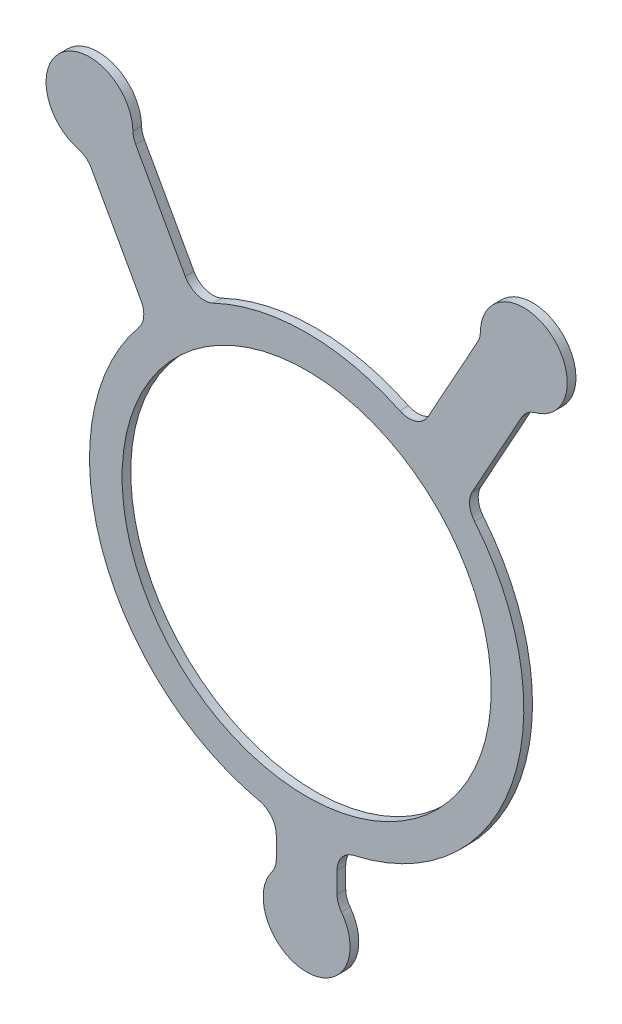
from build123d import *

# Parameters (mm, degrees)
SKETCH1_R          = 53.975
BASE_EXTRUDE_DEPTH = 2.54


with BuildPart() as part:
    # Sketch1 → Base-Extrude (new body)
    with BuildSketch(Plane.XY):
        with BuildLine():
            Line((50.008687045, 171.923839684), (35.512218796, 145.748360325))
            ThreePointArc((35.512218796, 145.748360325), (31.899714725, 142.779219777), (27.233844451, 143.088470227))
            ThreePointArc((27.233844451, 143.088470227), (0, 149.225), (-27.233844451, 143.088470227))
            ThreePointArc((-27.233844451, 143.088470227), (-31.899714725, 142.779219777), (-35.512218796, 145.748360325))
            Line((-35.512218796, 145.748360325), (-50.008687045, 171.923839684))
            ThreePointArc((-50.008687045, 171.923839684), (-50.585784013, 173.351051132), (-50.802464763, 174.875197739))
            ThreePointArc((-50.802464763, 174.875197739), (-71.318679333, 184.632909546), (-66.815120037, 162.365310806))
            ThreePointArc((-66.815120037, 162.365310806), (-64.556557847, 161.234114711), (-62.917690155, 159.311923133))
            Line((-62.917690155, 159.311923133), (-48.421221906, 133.136443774))
            ThreePointArc((-48.421221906, 133.136443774), (-47.652448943, 129.483338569), (-49.069283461, 126.0295335))
            ThreePointArc((-49.069283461, 126.0295335), (-60.040658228, 65.052086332), (-13.854545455, 23.754833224))
            ThreePointArc((-13.854545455, 23.754833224), (-10.284188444, 21.528009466), (-8.89, 17.557816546))
            Line((-8.89, 17.557816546), (-8.89, 11.43))
            ThreePointArc((-8.89, 11.43), (-9.215861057, 9.421953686), (-10.16, 7.62))
            ThreePointArc((-10.16, 7.62), (0, -12.7), (10.16, 7.62))
            ThreePointArc((10.16, 7.62), (9.215861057, 9.421953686), (8.89, 11.43))
            Line((8.89, 11.43), (8.89, 17.557816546))
            ThreePointArc((8.89, 17.557816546), (10.284188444, 21.528009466), (13.854545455, 23.754833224))
            ThreePointArc((13.854545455, 23.754833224), (60.040658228, 65.052086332), (49.069283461, 126.0295335))
            ThreePointArc((49.069283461, 126.0295335), (47.652448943, 129.483338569), (48.421221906, 133.136443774))
            Line((48.421221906, 133.136443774), (62.917690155, 159.311923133))
            ThreePointArc((62.917690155, 159.311923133), (64.556557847, 161.234114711), (66.815120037, 162.365310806))
            ThreePointArc((66.815120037, 162.365310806), (71.318679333, 184.632909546), (50.802464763, 174.875197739))
            ThreePointArc((50.802464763, 174.875197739), (50.585784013, 173.351051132), (50.008687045, 171.923839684))
        make_face()
        with Locations((0, 85.725)):
            Circle(SKETCH1_R, mode=Mode.SUBTRACT)
    extrude(amount=BASE_EXTRUDE_DEPTH)


solid = part.part
